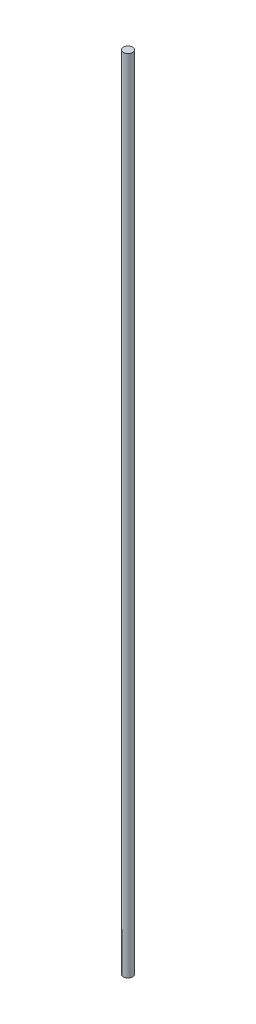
ISO-10303-21;
HEADER;
FILE_DESCRIPTION(('STEP AP214'),'2;1');
FILE_NAME('part.step','',(''),(''),'','','');
FILE_SCHEMA(('AUTOMOTIVE_DESIGN { 1 0 10303 214 1 1 1 1 }'));
ENDSEC;
DATA;
#1=APPLICATION_CONTEXT('core data for automotive mechanical design processes');
#2=APPLICATION_PROTOCOL_DEFINITION('international standard','automotive_design',2000,#1);
#3=PRODUCT_CONTEXT('',#1,'mechanical');
#4=PRODUCT('Part','Part','',(#3));
#5=PRODUCT_RELATED_PRODUCT_CATEGORY('part','',(#4));
#6=PRODUCT_DEFINITION_FORMATION('','',#4);
#7=PRODUCT_DEFINITION_CONTEXT('part definition',#1,'design');
#8=PRODUCT_DEFINITION('design','',#6,#7);
#9=PRODUCT_DEFINITION_SHAPE('','',#8);
#10=(LENGTH_UNIT() NAMED_UNIT(*) SI_UNIT(.MILLI.,.METRE.));
#11=(NAMED_UNIT(*) PLANE_ANGLE_UNIT() SI_UNIT($,.RADIAN.));
#12=(NAMED_UNIT(*) SI_UNIT($,.STERADIAN.) SOLID_ANGLE_UNIT());
#13=UNCERTAINTY_MEASURE_WITH_UNIT(LENGTH_MEASURE(1.E-05),#10,'distance_accuracy_value','');
#14=(GEOMETRIC_REPRESENTATION_CONTEXT(3) GLOBAL_UNCERTAINTY_ASSIGNED_CONTEXT((#13)) GLOBAL_UNIT_ASSIGNED_CONTEXT((#10,
#11,#12)) REPRESENTATION_CONTEXT('',''));
#15=CARTESIAN_POINT('',(0.,0.,0.));
#16=DIRECTION('',(0.,0.,1.));
#17=DIRECTION('',(1.,0.,0.));
#18=AXIS2_PLACEMENT_3D('',#15,#16,#17);
#19=CARTESIAN_POINT('',(0.,152.4,0.));
#20=DIRECTION('',(0.,-1.,0.));
#21=DIRECTION('',(0.,0.,-1.));
#22=AXIS2_PLACEMENT_3D('',#19,#20,#21);
#23=CYLINDRICAL_SURFACE('',#22,0.875);
#24=CARTESIAN_POINT('',(0.,152.4,0.));
#25=DIRECTION('',(0.,1.,0.));
#26=DIRECTION('',(0.,0.,1.));
#27=AXIS2_PLACEMENT_3D('',#24,#25,#26);
#28=CIRCLE('',#27,0.875);
#29=CARTESIAN_POINT('',(0.,152.4,-0.875));
#30=VERTEX_POINT('',#29);
#31=EDGE_CURVE('E10',#30,#30,#28,.T.);
#32=CARTESIAN_POINT('',(0.,0.,0.));
#33=DIRECTION('',(0.,1.,0.));
#34=DIRECTION('',(0.,0.,1.));
#35=AXIS2_PLACEMENT_3D('',#32,#33,#34);
#36=CIRCLE('',#35,0.875);
#37=CARTESIAN_POINT('',(0.,0.,-0.875));
#38=VERTEX_POINT('',#37);
#39=EDGE_CURVE('E40',#38,#38,#36,.T.);
#40=CARTESIAN_POINT('',(0.,152.4,-0.875));
#41=CARTESIAN_POINT('',(0.,150.8125,-0.875));
#42=CARTESIAN_POINT('',(0.,149.225,-0.875));
#43=CARTESIAN_POINT('',(0.,146.05,-0.875));
#44=CARTESIAN_POINT('',(0.,144.4625,-0.875));
#45=CARTESIAN_POINT('',(0.,141.2875,-0.875));
#46=CARTESIAN_POINT('',(0.,139.7,-0.875));
#47=CARTESIAN_POINT('',(0.,136.525,-0.875));
#48=CARTESIAN_POINT('',(0.,134.9375,-0.875));
#49=CARTESIAN_POINT('',(0.,131.7625,-0.875));
#50=CARTESIAN_POINT('',(0.,130.175,-0.875));
#51=CARTESIAN_POINT('',(0.,127.,-0.875));
#52=CARTESIAN_POINT('',(0.,125.4125,-0.875));
#53=CARTESIAN_POINT('',(0.,122.2375,-0.875));
#54=CARTESIAN_POINT('',(0.,120.65,-0.875));
#55=CARTESIAN_POINT('',(0.,117.475,-0.875));
#56=CARTESIAN_POINT('',(0.,115.8875,-0.875));
#57=CARTESIAN_POINT('',(0.,112.7125,-0.875));
#58=CARTESIAN_POINT('',(0.,111.125,-0.875));
#59=CARTESIAN_POINT('',(0.,107.95,-0.875));
#60=CARTESIAN_POINT('',(0.,106.3625,-0.875));
#61=CARTESIAN_POINT('',(0.,103.1875,-0.875));
#62=CARTESIAN_POINT('',(0.,101.6,-0.875));
#63=CARTESIAN_POINT('',(0.,98.425,-0.875));
#64=CARTESIAN_POINT('',(0.,96.8375,-0.875));
#65=CARTESIAN_POINT('',(0.,93.6625,-0.875));
#66=CARTESIAN_POINT('',(0.,92.075,-0.875));
#67=CARTESIAN_POINT('',(0.,88.9,-0.875));
#68=CARTESIAN_POINT('',(0.,87.3125,-0.875));
#69=CARTESIAN_POINT('',(0.,84.1375,-0.875));
#70=CARTESIAN_POINT('',(0.,82.55,-0.875));
#71=CARTESIAN_POINT('',(0.,79.375,-0.875));
#72=CARTESIAN_POINT('',(0.,77.7875,-0.875));
#73=CARTESIAN_POINT('',(0.,74.6125,-0.875));
#74=CARTESIAN_POINT('',(0.,73.025,-0.875));
#75=CARTESIAN_POINT('',(0.,69.85,-0.875));
#76=CARTESIAN_POINT('',(0.,68.2625,-0.875));
#77=CARTESIAN_POINT('',(0.,65.0875,-0.875));
#78=CARTESIAN_POINT('',(0.,63.5,-0.875));
#79=CARTESIAN_POINT('',(0.,60.325,-0.875));
#80=CARTESIAN_POINT('',(0.,58.7375,-0.875));
#81=CARTESIAN_POINT('',(0.,55.5625,-0.875));
#82=CARTESIAN_POINT('',(0.,53.975,-0.875));
#83=CARTESIAN_POINT('',(0.,50.8,-0.875));
#84=CARTESIAN_POINT('',(0.,49.2125,-0.875));
#85=CARTESIAN_POINT('',(0.,46.0375,-0.875));
#86=CARTESIAN_POINT('',(0.,44.45,-0.875));
#87=CARTESIAN_POINT('',(0.,41.275,-0.875));
#88=CARTESIAN_POINT('',(0.,39.6875,-0.875));
#89=CARTESIAN_POINT('',(0.,36.5125,-0.875));
#90=CARTESIAN_POINT('',(0.,34.925,-0.875));
#91=CARTESIAN_POINT('',(0.,31.75,-0.875));
#92=CARTESIAN_POINT('',(0.,30.1625,-0.875));
#93=CARTESIAN_POINT('',(0.,26.9875,-0.875));
#94=CARTESIAN_POINT('',(0.,25.4,-0.875));
#95=CARTESIAN_POINT('',(0.,22.225,-0.875));
#96=CARTESIAN_POINT('',(0.,20.6375,-0.875));
#97=CARTESIAN_POINT('',(0.,17.4625,-0.875));
#98=CARTESIAN_POINT('',(0.,15.875,-0.875));
#99=CARTESIAN_POINT('',(0.,12.7,-0.875));
#100=CARTESIAN_POINT('',(0.,11.1125,-0.875));
#101=CARTESIAN_POINT('',(0.,7.93750000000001,-0.875));
#102=CARTESIAN_POINT('',(0.,6.35,-0.875));
#103=CARTESIAN_POINT('',(0.,3.175,-0.875));
#104=CARTESIAN_POINT('',(0.,1.5875,-0.875));
#105=CARTESIAN_POINT('',(0.,0.,-0.875));
#106=B_SPLINE_CURVE_WITH_KNOTS('',3,(#40,#41,#42,#43,#44,#45,#46,#47,#48,#49,#50,#51,#52,#53,
#54,#55,#56,#57,#58,#59,#60,#61,#62,#63,#64,#65,#66,#67,#68,#69,#70,#71,#72,#73,#74,#75,#76,#77,
#78,#79,#80,#81,#82,#83,#84,#85,#86,#87,#88,#89,#90,#91,#92,#93,#94,#95,#96,#97,#98,#99,#100,
#101,#102,#103,#104,#105),.UNSPECIFIED.,.F.,.F.,(4,2,2,2,2,2,2,2,2,2,2,2,2,2,2,2,2,2,2,2,2,2,2,
2,2,2,2,2,2,2,2,2,4),(0.,4.7625,9.52500000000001,14.2875,19.05,23.8125,28.575,33.3375,38.1,
42.8625,47.625,52.3875,57.15,61.9125,66.675,71.4375,76.2,80.9625,85.725,90.4875,95.25,100.0125,
104.775,109.5375,114.3,119.0625,123.825,128.5875,133.35,138.1125,142.875,147.6375,152.4),.UNSPECIFIED.);
#107=EDGE_CURVE('BSEAM37',#30,#38,#106,.T.);
#108=ORIENTED_EDGE('',*,*,#31,.F.);
#109=ORIENTED_EDGE('',*,*,#39,.T.);
#110=ORIENTED_EDGE('',*,*,#107,.T.);
#111=ORIENTED_EDGE('',*,*,#107,.F.);
#112=EDGE_LOOP('',(#108,#110,#109,#111));
#113=FACE_BOUND('',#112,.T.);
#114=ADVANCED_FACE('F37',(#113),#23,.T.);
#115=CARTESIAN_POINT('',(0.,152.4,0.));
#116=DIRECTION('',(0.,1.,0.));
#117=DIRECTION('',(0.,0.,1.));
#118=AXIS2_PLACEMENT_3D('',#115,#116,#117);
#119=PLANE('',#118);
#120=ORIENTED_EDGE('',*,*,#31,.T.);
#121=EDGE_LOOP('',(#120));
#122=FACE_BOUND('',#121,.T.);
#123=ADVANCED_FACE('F52',(#122),#119,.T.);
#124=CARTESIAN_POINT('',(0.,0.,0.));
#125=DIRECTION('',(0.,1.,0.));
#126=DIRECTION('',(0.,0.,1.));
#127=AXIS2_PLACEMENT_3D('',#124,#125,#126);
#128=PLANE('',#127);
#129=ORIENTED_EDGE('',*,*,#39,.F.);
#130=EDGE_LOOP('',(#129));
#131=FACE_BOUND('',#130,.T.);
#132=ADVANCED_FACE('F50',(#131),#128,.F.);
#133=CLOSED_SHELL('',(#114,#123,#132));
#134=MANIFOLD_SOLID_BREP('B2',#133);
#135=ADVANCED_BREP_SHAPE_REPRESENTATION('',(#18,#134),#14);
#136=SHAPE_DEFINITION_REPRESENTATION(#9,#135);
ENDSEC;
END-ISO-10303-21;
